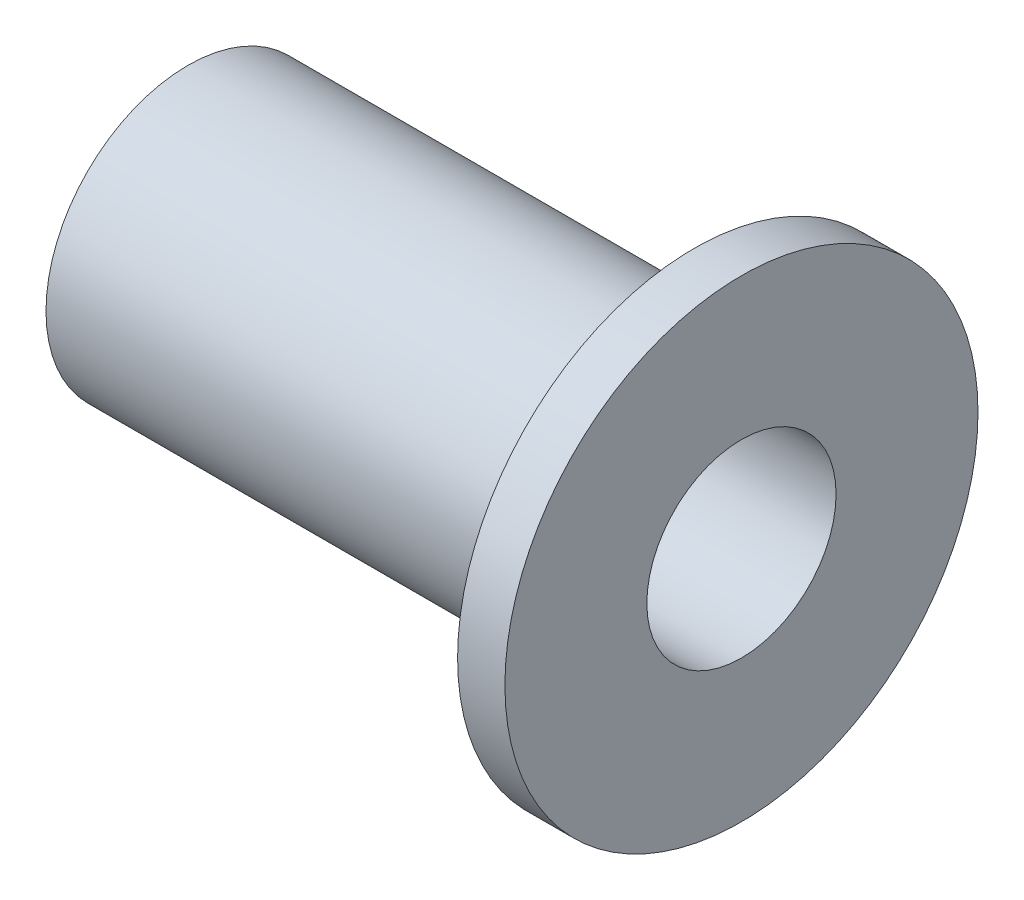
from build123d import *


with BuildPart() as part:
    # Esquisse1 → Base-R_volution (revolve)
    with BuildSketch(Plane.XY, mode=Mode.PRIVATE) as base_r_volution_sk:
        Polygon((0, 2), (0, 3), (10.1, 3), (10.7, 5), (11.7, 5), (11.7, 2), align=None)
    revolve(base_r_volution_sk.sketch.rotate(Axis((-13.304761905, 0, 0), (1, 0, 0)), 90), axis=Axis((-13.304761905, 0, 0), (1, 0, 0)))


solid = part.part
